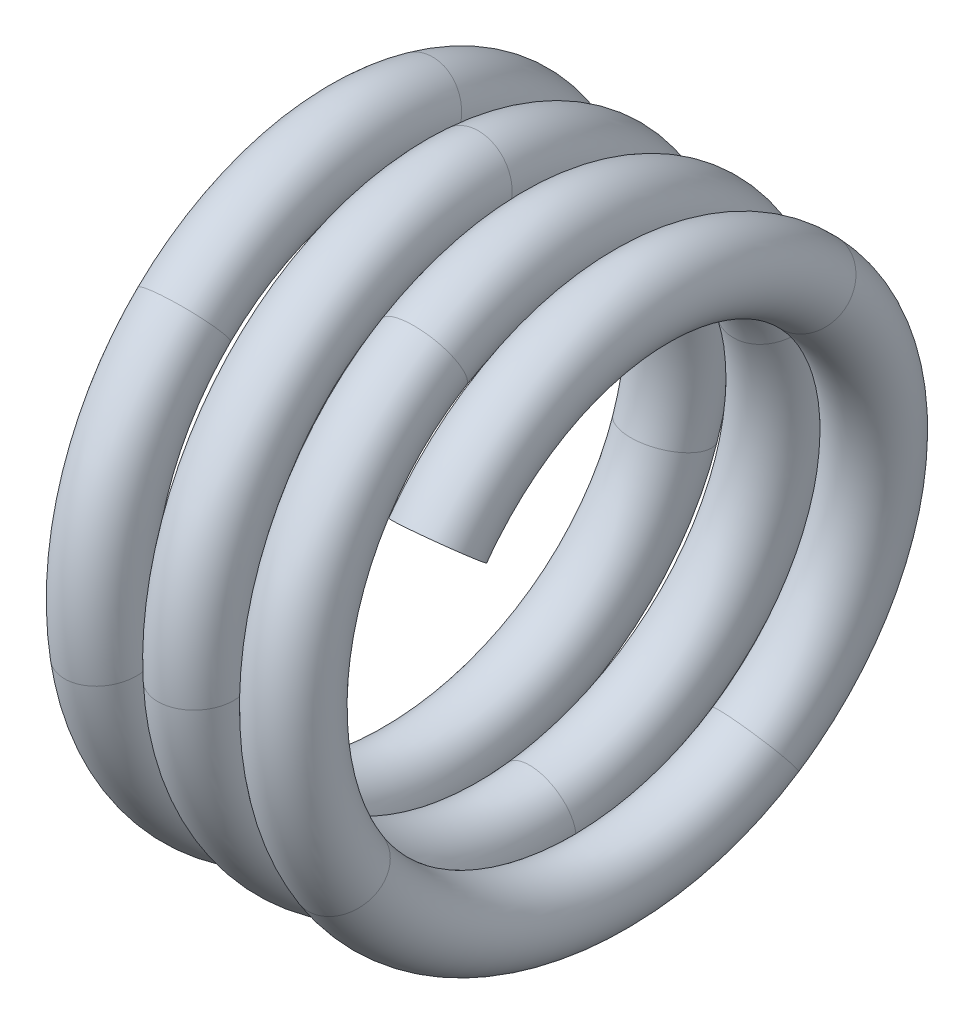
ISO-10303-21;
HEADER;
FILE_DESCRIPTION(('STEP AP214'),'2;1');
FILE_NAME('part.step','',(''),(''),'','','');
FILE_SCHEMA(('AUTOMOTIVE_DESIGN { 1 0 10303 214 1 1 1 1 }'));
ENDSEC;
DATA;
#1=APPLICATION_CONTEXT('core data for automotive mechanical design processes');
#2=APPLICATION_PROTOCOL_DEFINITION('international standard','automotive_design',2000,#1);
#3=PRODUCT_CONTEXT('',#1,'mechanical');
#4=PRODUCT('Part','Part','',(#3));
#5=PRODUCT_RELATED_PRODUCT_CATEGORY('part','',(#4));
#6=PRODUCT_DEFINITION_FORMATION('','',#4);
#7=PRODUCT_DEFINITION_CONTEXT('part definition',#1,'design');
#8=PRODUCT_DEFINITION('design','',#6,#7);
#9=PRODUCT_DEFINITION_SHAPE('','',#8);
#10=(LENGTH_UNIT() NAMED_UNIT(*) SI_UNIT(.MILLI.,.METRE.));
#11=(NAMED_UNIT(*) PLANE_ANGLE_UNIT() SI_UNIT($,.RADIAN.));
#12=(NAMED_UNIT(*) SI_UNIT($,.STERADIAN.) SOLID_ANGLE_UNIT());
#13=UNCERTAINTY_MEASURE_WITH_UNIT(LENGTH_MEASURE(1.E-05),#10,'distance_accuracy_value','');
#14=(GEOMETRIC_REPRESENTATION_CONTEXT(3) GLOBAL_UNCERTAINTY_ASSIGNED_CONTEXT((#13)) GLOBAL_UNIT_ASSIGNED_CONTEXT((#10,
#11,#12)) REPRESENTATION_CONTEXT('',''));
#15=CARTESIAN_POINT('',(0.,0.,0.));
#16=DIRECTION('',(0.,0.,1.));
#17=DIRECTION('',(1.,0.,0.));
#18=AXIS2_PLACEMENT_3D('',#15,#16,#17);
#19=CARTESIAN_POINT('',(-5.715,48.4899319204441,5.50100058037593));
#20=DIRECTION('',(-0.0566234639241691,-0.964376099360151,-0.258403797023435));
#21=DIRECTION('',(0.,0.258819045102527,-0.965925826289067));
#22=AXIS2_PLACEMENT_3D('',#19,#20,#21);
#23=PLANE('',#22);
#24=CARTESIAN_POINT('',(-5.70701517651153,48.3843308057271,5.8933596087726));
#25=CARTESIAN_POINT('',(-5.68424170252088,48.383199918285,5.89258983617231));
#26=CARTESIAN_POINT('',(-5.6614853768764,48.3825680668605,5.88996139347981));
#27=CARTESIAN_POINT('',(-5.61665573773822,48.3823248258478,5.88104575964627));
#28=CARTESIAN_POINT('',(-5.59458399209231,48.3827156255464,5.87475074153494));
#29=CARTESIAN_POINT('',(-5.55182699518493,48.3845083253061,5.85869104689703));
#30=CARTESIAN_POINT('',(-5.53113934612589,48.3859084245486,5.84893256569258));
#31=CARTESIAN_POINT('',(-5.49166932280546,48.3896810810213,5.82620383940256));
#32=CARTESIAN_POINT('',(-5.47288970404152,48.3920550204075,5.8132290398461));
#33=CARTESIAN_POINT('',(-5.4378272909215,48.3977038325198,5.78446423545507));
#34=CARTESIAN_POINT('',(-5.4215410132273,48.400977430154,5.76867822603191));
#35=CARTESIAN_POINT('',(-5.39187446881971,48.4083394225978,5.73470213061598));
#36=CARTESIAN_POINT('',(-5.37849830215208,48.4124289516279,5.71650871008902));
#37=CARTESIAN_POINT('',(-5.3550698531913,48.4213003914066,5.67826622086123));
#38=CARTESIAN_POINT('',(-5.34501515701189,48.4260817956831,5.65821851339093));
#39=CARTESIAN_POINT('',(-5.32850111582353,48.436203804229,5.61682397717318));
#40=CARTESIAN_POINT('',(-5.3220419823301,48.4415444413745,5.59547707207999));
#41=CARTESIAN_POINT('',(-5.31290350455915,48.4526328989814,5.55209189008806));
#42=CARTESIAN_POINT('',(-5.31022404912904,48.4583807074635,5.53005363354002));
#43=CARTESIAN_POINT('',(-5.30872062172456,48.4701204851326,5.48591074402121));
#44=CARTESIAN_POINT('',(-5.3098966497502,48.4761124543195,5.46380611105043));
#45=CARTESIAN_POINT('',(-5.31607090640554,48.4881706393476,5.4201573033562));
#46=CARTESIAN_POINT('',(-5.32106924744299,48.4942368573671,5.39861314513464));
#47=CARTESIAN_POINT('',(-5.33474593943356,48.5062707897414,5.35669884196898));
#48=CARTESIAN_POINT('',(-5.34342407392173,48.512238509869,5.33632862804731));
#49=CARTESIAN_POINT('',(-5.36422165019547,48.523910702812,5.29732473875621));
#50=CARTESIAN_POINT('',(-5.37634359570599,48.5296149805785,5.27869233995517));
#51=CARTESIAN_POINT('',(-5.40366239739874,48.5405857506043,5.24373517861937));
#52=CARTESIAN_POINT('',(-5.41885493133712,48.5458528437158,5.22740722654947));
#53=CARTESIAN_POINT('',(-5.4519180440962,48.5558159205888,5.1974695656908));
#54=CARTESIAN_POINT('',(-5.46979237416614,48.5605110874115,5.18386372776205));
#55=CARTESIAN_POINT('',(-5.50766884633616,48.5691819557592,5.15980339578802));
#56=CARTESIAN_POINT('',(-5.52766792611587,48.5731586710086,5.14934444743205));
#57=CARTESIAN_POINT('',(-5.56928152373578,48.5802944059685,5.13183221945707));
#58=CARTESIAN_POINT('',(-5.59089885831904,48.5834519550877,5.12478504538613));
#59=CARTESIAN_POINT('',(-5.63506901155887,48.5888449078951,5.11433718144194));
#60=CARTESIAN_POINT('',(-5.65761973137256,48.5910822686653,5.11092872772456));
#61=CARTESIAN_POINT('',(-5.69450248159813,48.5939239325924,5.10840553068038));
#62=CARTESIAN_POINT('',(-5.70874700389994,48.5948260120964,5.10816029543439));
#63=CARTESIAN_POINT('',(-5.74575829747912,48.5966639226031,5.10941132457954));
#64=CARTESIAN_POINT('',(-5.7685146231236,48.5972957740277,5.11203976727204));
#65=CARTESIAN_POINT('',(-5.81334426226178,48.5975390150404,5.12095540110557));
#66=CARTESIAN_POINT('',(-5.83541600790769,48.5971482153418,5.1272504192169));
#67=CARTESIAN_POINT('',(-5.87817300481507,48.595355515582,5.14331011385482));
#68=CARTESIAN_POINT('',(-5.8988606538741,48.5939554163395,5.15306859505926));
#69=CARTESIAN_POINT('',(-5.93833067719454,48.5901827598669,5.17579732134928));
#70=CARTESIAN_POINT('',(-5.95711029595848,48.5878088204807,5.18877212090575));
#71=CARTESIAN_POINT('',(-5.99217270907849,48.5821600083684,5.21753692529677));
#72=CARTESIAN_POINT('',(-6.00845898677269,48.5788864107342,5.23332293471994));
#73=CARTESIAN_POINT('',(-6.03812553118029,48.5715244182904,5.26729903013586));
#74=CARTESIAN_POINT('',(-6.05150169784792,48.5674348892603,5.28549245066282));
#75=CARTESIAN_POINT('',(-6.0749301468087,48.5585634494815,5.32373493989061));
#76=CARTESIAN_POINT('',(-6.08498484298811,48.5537820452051,5.34378264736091));
#77=CARTESIAN_POINT('',(-6.10149888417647,48.5436600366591,5.38517718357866));
#78=CARTESIAN_POINT('',(-6.1079580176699,48.5383193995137,5.40652408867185));
#79=CARTESIAN_POINT('',(-6.11709649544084,48.5272309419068,5.44990927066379));
#80=CARTESIAN_POINT('',(-6.11977595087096,48.5214831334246,5.47194752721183));
#81=CARTESIAN_POINT('',(-6.12127937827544,48.5097433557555,5.51609041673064));
#82=CARTESIAN_POINT('',(-6.1201033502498,48.5037513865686,5.53819504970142));
#83=CARTESIAN_POINT('',(-6.11392909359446,48.4916932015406,5.58184385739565));
#84=CARTESIAN_POINT('',(-6.10893075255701,48.4856269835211,5.60338801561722));
#85=CARTESIAN_POINT('',(-6.09525406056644,48.4735930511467,5.64530231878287));
#86=CARTESIAN_POINT('',(-6.08657592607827,48.4676253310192,5.66567253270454));
#87=CARTESIAN_POINT('',(-6.06577834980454,48.4559531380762,5.70467642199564));
#88=CARTESIAN_POINT('',(-6.05365640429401,48.4502488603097,5.72330882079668));
#89=CARTESIAN_POINT('',(-6.02633760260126,48.4392780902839,5.75826598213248));
#90=CARTESIAN_POINT('',(-6.01114506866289,48.4340109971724,5.77459393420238));
#91=CARTESIAN_POINT('',(-5.9780819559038,48.4240479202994,5.80453159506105));
#92=CARTESIAN_POINT('',(-5.96020762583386,48.4193527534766,5.8181374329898));
#93=CARTESIAN_POINT('',(-5.92233115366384,48.4106818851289,5.84219776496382));
#94=CARTESIAN_POINT('',(-5.90233207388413,48.4067051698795,5.8526567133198));
#95=CARTESIAN_POINT('',(-5.86071847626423,48.3995694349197,5.87016894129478));
#96=CARTESIAN_POINT('',(-5.83910114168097,48.3964118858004,5.87721611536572));
#97=CARTESIAN_POINT('',(-5.79493098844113,48.391018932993,5.8876639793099));
#98=CARTESIAN_POINT('',(-5.77238026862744,48.3887815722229,5.89107243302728));
#99=CARTESIAN_POINT('',(-5.73549751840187,48.3859399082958,5.89359563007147));
#100=CARTESIAN_POINT('',(-5.72125299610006,48.3850378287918,5.89384086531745));
#101=CARTESIAN_POINT('',(-5.70701517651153,48.3843308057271,5.8933596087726));
#102=B_SPLINE_CURVE_WITH_KNOTS('',3,(#24,#25,#26,#27,#28,#29,#30,#31,#32,#33,#34,#35,#36,#37,
#38,#39,#40,#41,#42,#43,#44,#45,#46,#47,#48,#49,#50,#51,#52,#53,#54,#55,#56,#57,#58,#59,#60,#61,
#62,#63,#64,#65,#66,#67,#68,#69,#70,#71,#72,#73,#74,#75,#76,#77,#78,#79,#80,#81,#82,#83,#84,#85,
#86,#87,#88,#89,#90,#91,#92,#93,#94,#95,#96,#97,#98,#99,#100,#101),.UNSPECIFIED.,.T.,.F.,(4,2,2,
2,2,2,2,2,2,2,2,2,2,2,2,2,2,2,2,2,2,2,2,2,2,2,2,2,2,2,2,2,2,2,2,2,2,2,4),(0.,0.0683988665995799,
0.136944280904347,0.205367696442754,0.273888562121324,0.342312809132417,0.410832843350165,
0.479302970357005,0.547777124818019,0.616249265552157,0.684721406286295,0.753195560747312,
0.821665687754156,0.890185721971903,0.958609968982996,1.02713083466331,1.09555425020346,
1.16409966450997,1.23249853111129,1.27526103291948,1.34365989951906,1.41220531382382,
1.48062872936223,1.5491495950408,1.61757384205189,1.68609387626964,1.75456400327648,
1.8230381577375,1.89151029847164,1.95998243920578,2.0284565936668,2.09692672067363,
2.16544675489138,2.23387100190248,2.30239186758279,2.37081528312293,2.43936069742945,
2.50775956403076,2.55052206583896),.UNSPECIFIED.);
#103=CARTESIAN_POINT('',(-5.70701517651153,48.3843308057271,5.8933596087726));
#104=VERTEX_POINT('',#103);
#105=EDGE_CURVE('E20',#104,#104,#102,.T.);
#106=ORIENTED_EDGE('',*,*,#105,.F.);
#107=EDGE_LOOP('',(#106));
#108=FACE_BOUND('',#107,.T.);
#109=ADVANCED_FACE('F15',(#108),#23,.T.);
#110=CARTESIAN_POINT('',(-5.65891132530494,47.7481463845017,8.25709129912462));
#111=DIRECTION('',(-0.998202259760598,0.049590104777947,0.0336611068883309));
#112=DIRECTION('',(0.0566234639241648,0.964376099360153,0.258403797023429));
#113=AXIS2_PLACEMENT_3D('',#110,#111,#112);
#114=TOROIDAL_SURFACE('',#113,2.85472026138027,0.4064);
#115=CARTESIAN_POINT('',(-5.55337484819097,50.4643835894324,7.38511350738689));
#116=DIRECTION('',(-0.0471755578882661,-0.303657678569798,-0.951612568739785));
#117=DIRECTION('',(-0.0368704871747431,0.952553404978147,-0.302130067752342));
#118=AXIS2_PLACEMENT_3D('',#115,#116,#117);
#119=CIRCLE('',#118,0.4064);
#120=CARTESIAN_POINT('',(-5.56835901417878,50.8515012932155,7.26232784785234));
#121=VERTEX_POINT('',#120);
#122=EDGE_CURVE('E207',#121,#121,#119,.F.);
#123=ORIENTED_EDGE('',*,*,#122,.F.);
#124=EDGE_LOOP('',(#123));
#125=FACE_BOUND('',#124,.T.);
#126=ORIENTED_EDGE('',*,*,#105,.T.);
#127=EDGE_LOOP('',(#126));
#128=FACE_BOUND('',#127,.T.);
#129=ADVANCED_FACE('F182',(#125,#128),#114,.T.);
#130=CARTESIAN_POINT('',(-5.44784807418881,47.73808687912,8.24983794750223));
#131=DIRECTION('',(-0.998205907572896,-0.0208332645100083,0.0561332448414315));
#132=DIRECTION('',(0.0596135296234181,-0.258358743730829,0.964207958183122));
#133=AXIS2_PLACEMENT_3D('',#130,#131,#132);
#134=TOROIDAL_SURFACE('',#133,2.86209329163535,0.4064);
#135=CARTESIAN_POINT('',(-5.39181253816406,49.9487780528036,10.0667811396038));
#136=DIRECTION('',(-0.0565831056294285,0.634790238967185,-0.770609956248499));
#137=DIRECTION('',(-0.0194448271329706,0.770999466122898,0.636538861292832));
#138=AXIS2_PLACEMENT_3D('',#135,#136,#137);
#139=CIRCLE('',#138,0.4064);
#140=CARTESIAN_POINT('',(-5.3997149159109,50.262112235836,10.3254705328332));
#141=VERTEX_POINT('',#140);
#142=EDGE_CURVE('E46',#141,#141,#139,.F.);
#143=ORIENTED_EDGE('',*,*,#142,.F.);
#144=EDGE_LOOP('',(#143));
#145=FACE_BOUND('',#144,.T.);
#146=ORIENTED_EDGE('',*,*,#122,.T.);
#147=EDGE_LOOP('',(#146));
#148=FACE_BOUND('',#147,.T.);
#149=ADVANCED_FACE('F174',(#145,#148),#134,.T.);
#150=CARTESIAN_POINT('',(-5.12427549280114,47.7505319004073,8.26145350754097));
#151=DIRECTION('',(-0.998198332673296,-0.0423209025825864,-0.0425326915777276));
#152=DIRECTION('',(-0.0519106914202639,0.964623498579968,0.258470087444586));
#153=AXIS2_PLACEMENT_3D('',#150,#151,#152);
#154=TOROIDAL_SURFACE('',#153,2.84652874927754,0.4064);
#155=CARTESIAN_POINT('',(-5.06862507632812,45.1898121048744,9.50336456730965));
#156=DIRECTION('',(-0.0567263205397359,0.434672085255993,0.898800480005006));
#157=DIRECTION('',(-0.0363871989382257,-0.900552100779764,0.433222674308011));
#158=AXIS2_PLACEMENT_3D('',#155,#156,#157);
#159=CIRCLE('',#158,0.4064);
#160=CARTESIAN_POINT('',(-5.08341283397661,44.8238277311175,9.67942626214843));
#161=VERTEX_POINT('',#160);
#162=EDGE_CURVE('E10',#161,#161,#159,.F.);
#163=ORIENTED_EDGE('',*,*,#162,.F.);
#164=EDGE_LOOP('',(#163));
#165=FACE_BOUND('',#164,.T.);
#166=CARTESIAN_POINT('',(-5.2303304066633,47.4133541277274,11.0859515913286));
#167=DIRECTION('',(-0.0470314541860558,0.992057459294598,0.116662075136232));
#168=DIRECTION('',(0.0369836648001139,-0.114981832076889,0.99267889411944));
#169=AXIS2_PLACEMENT_3D('',#166,#167,#168);
#170=CIRCLE('',#169,0.4064);
#171=CARTESIAN_POINT('',(-5.21530024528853,47.3666255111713,11.4893762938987));
#172=VERTEX_POINT('',#171);
#173=EDGE_CURVE('E210',#172,#172,#170,.T.);
#174=ORIENTED_EDGE('',*,*,#173,.F.);
#175=EDGE_LOOP('',(#174));
#176=FACE_BOUND('',#175,.T.);
#177=ADVANCED_FACE('F167',(#165,#176),#154,.T.);
#178=CARTESIAN_POINT('',(-5.33616702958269,47.74239909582,8.24518980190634));
#179=DIRECTION('',(-0.998208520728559,-0.051001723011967,0.0312821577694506));
#180=DIRECTION('',(0.0434532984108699,-0.25857457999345,0.965013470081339));
#181=AXIS2_PLACEMENT_3D('',#178,#179,#180);
#182=TOROIDAL_SURFACE('',#181,2.86171269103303,0.4064);
#183=ORIENTED_EDGE('',*,*,#173,.T.);
#184=EDGE_LOOP('',(#183));
#185=FACE_BOUND('',#184,.T.);
#186=ORIENTED_EDGE('',*,*,#142,.T.);
#187=EDGE_LOOP('',(#186));
#188=FACE_BOUND('',#187,.T.);
#189=ADVANCED_FACE('F160',(#185,#188),#182,.T.);
#190=CARTESIAN_POINT('',(-2.3142448,49.5831595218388,10.4375637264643));
#191=DIRECTION('',(-0.0566634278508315,0.762154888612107,-0.644910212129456));
#192=DIRECTION('',(0.,0.64594803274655,0.763381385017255));
#193=AXIS2_PLACEMENT_3D('',#190,#191,#192);
#194=PLANE('',#193);
#195=CARTESIAN_POINT('',(-2.32846079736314,49.3201915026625,10.1280371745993));
#196=CARTESIAN_POINT('',(-2.35122461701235,49.3197227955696,10.129483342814));
#197=CARTESIAN_POINT('',(-2.37394177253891,49.3204989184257,10.1323965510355));
#198=CARTESIAN_POINT('',(-2.41863489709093,49.3245296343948,10.1410869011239));
#199=CARTESIAN_POINT('',(-2.44060917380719,49.327789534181,10.1468701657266));
#200=CARTESIAN_POINT('',(-2.48311598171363,49.3366916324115,10.1611254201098));
#201=CARTESIAN_POINT('',(-2.50365100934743,49.342329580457,10.1695926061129));
#202=CARTESIAN_POINT('',(-2.54276457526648,49.3558375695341,10.1889929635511));
#203=CARTESIAN_POINT('',(-2.56134028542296,49.3637107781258,10.1999296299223));
#204=CARTESIAN_POINT('',(-2.59594989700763,49.38144941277,10.2239340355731));
#205=CARTESIAN_POINT('',(-2.61198734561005,49.3913120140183,10.2369987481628));
#206=CARTESIAN_POINT('',(-2.64111772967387,49.4127719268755,10.2649195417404));
#207=CARTESIAN_POINT('',(-2.6542065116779,49.42437164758,10.2797781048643));
#208=CARTESIAN_POINT('',(-2.67703035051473,49.4489567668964,10.3108381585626));
#209=CARTESIAN_POINT('',(-2.68676784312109,49.461941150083,10.3270386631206));
#210=CARTESIAN_POINT('',(-2.70262644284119,49.4889348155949,10.3603331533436));
#211=CARTESIAN_POINT('',(-2.70874733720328,49.5029441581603,10.3774271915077));
#212=CARTESIAN_POINT('',(-2.71719793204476,49.5315889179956,10.4120220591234));
#213=CARTESIAN_POINT('',(-2.71952774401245,49.5462243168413,10.4295228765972));
#214=CARTESIAN_POINT('',(-2.72033039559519,49.5757061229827,10.4644349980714));
#215=CARTESIAN_POINT('',(-2.71880323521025,49.5905525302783,10.4818463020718));
#216=CARTESIAN_POINT('',(-2.71193518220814,49.6200353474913,10.5160856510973));
#217=CARTESIAN_POINT('',(-2.70659417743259,49.63467175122,10.5329136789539));
#218=CARTESIAN_POINT('',(-2.69225038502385,49.6633177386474,10.5655072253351));
#219=CARTESIAN_POINT('',(-2.68324781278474,49.6773273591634,10.5812728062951));
#220=CARTESIAN_POINT('',(-2.66182854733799,49.7043329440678,10.6113060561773));
#221=CARTESIAN_POINT('',(-2.64940937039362,49.7173281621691,10.6255726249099));
#222=CARTESIAN_POINT('',(-2.62153240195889,49.7419068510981,10.6521703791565));
#223=CARTESIAN_POINT('',(-2.60607888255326,49.7534922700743,10.6645042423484));
#224=CARTESIAN_POINT('',(-2.57253665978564,49.7749593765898,10.6869269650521));
#225=CARTESIAN_POINT('',(-2.55444426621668,49.7848386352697,10.6970126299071));
#226=CARTESIAN_POINT('',(-2.51618146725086,49.8025797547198,10.7146172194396));
#227=CARTESIAN_POINT('',(-2.49601405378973,49.8104444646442,10.7221397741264));
#228=CARTESIAN_POINT('',(-2.45411768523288,49.8239641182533,10.7344361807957));
#229=CARTESIAN_POINT('',(-2.43238601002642,49.8296150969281,10.7392051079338));
#230=CARTESIAN_POINT('',(-2.38804497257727,49.8385167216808,10.7458291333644));
#231=CARTESIAN_POINT('',(-2.36543758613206,49.8417724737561,10.7476904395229));
#232=CARTESIAN_POINT('',(-2.32851060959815,49.8450549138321,10.7483251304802));
#233=CARTESIAN_POINT('',(-2.3142605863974,49.8458345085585,10.7479944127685));
#234=CARTESIAN_POINT('',(-2.27726498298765,49.8465962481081,10.7456441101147));
#235=CARTESIAN_POINT('',(-2.25454782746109,49.8458201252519,10.7427309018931));
#236=CARTESIAN_POINT('',(-2.20985470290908,49.8417894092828,10.7340405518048));
#237=CARTESIAN_POINT('',(-2.18788042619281,49.8385295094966,10.7282572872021));
#238=CARTESIAN_POINT('',(-2.14537361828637,49.8296274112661,10.7140020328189));
#239=CARTESIAN_POINT('',(-2.12483859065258,49.8239894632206,10.7055348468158));
#240=CARTESIAN_POINT('',(-2.08572502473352,49.8104814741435,10.6861344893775));
#241=CARTESIAN_POINT('',(-2.06714931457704,49.8026082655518,10.6751978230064));
#242=CARTESIAN_POINT('',(-2.03253970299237,49.7848696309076,10.6511934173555));
#243=CARTESIAN_POINT('',(-2.01650225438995,49.7750070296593,10.6381287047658));
#244=CARTESIAN_POINT('',(-1.98737187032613,49.7535471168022,10.6102079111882));
#245=CARTESIAN_POINT('',(-1.97428308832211,49.7419473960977,10.5953493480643));
#246=CARTESIAN_POINT('',(-1.95145924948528,49.7173622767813,10.564289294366));
#247=CARTESIAN_POINT('',(-1.94172175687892,49.7043778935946,10.548088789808));
#248=CARTESIAN_POINT('',(-1.92586315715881,49.6773842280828,10.514794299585));
#249=CARTESIAN_POINT('',(-1.91974226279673,49.6633748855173,10.4977002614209));
#250=CARTESIAN_POINT('',(-1.91129166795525,49.6347301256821,10.4631053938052));
#251=CARTESIAN_POINT('',(-1.90896185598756,49.6200947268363,10.4456045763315));
#252=CARTESIAN_POINT('',(-1.90815920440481,49.590612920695,10.4106924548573));
#253=CARTESIAN_POINT('',(-1.90968636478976,49.5757665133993,10.3932811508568));
#254=CARTESIAN_POINT('',(-1.91655441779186,49.5462836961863,10.3590418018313));
#255=CARTESIAN_POINT('',(-1.9218954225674,49.5316472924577,10.3422137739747));
#256=CARTESIAN_POINT('',(-1.93623921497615,49.5030013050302,10.3096202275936));
#257=CARTESIAN_POINT('',(-1.94524178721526,49.4889916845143,10.2938546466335));
#258=CARTESIAN_POINT('',(-1.96666105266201,49.4619860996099,10.2638213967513));
#259=CARTESIAN_POINT('',(-1.97908022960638,49.4489908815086,10.2495548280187));
#260=CARTESIAN_POINT('',(-2.00695719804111,49.4244121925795,10.2229570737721));
#261=CARTESIAN_POINT('',(-2.02241071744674,49.4128267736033,10.2106232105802));
#262=CARTESIAN_POINT('',(-2.05595294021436,49.3913596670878,10.1882004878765));
#263=CARTESIAN_POINT('',(-2.07404533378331,49.3814804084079,10.1781148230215));
#264=CARTESIAN_POINT('',(-2.11230813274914,49.3637392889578,10.160510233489));
#265=CARTESIAN_POINT('',(-2.13247554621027,49.3558745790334,10.1529876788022));
#266=CARTESIAN_POINT('',(-2.17437191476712,49.3423549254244,10.1406912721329));
#267=CARTESIAN_POINT('',(-2.19610358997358,49.3367039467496,10.1359223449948));
#268=CARTESIAN_POINT('',(-2.24044462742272,49.3278023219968,10.1292983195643));
#269=CARTESIAN_POINT('',(-2.26305201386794,49.3245465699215,10.1274370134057));
#270=CARTESIAN_POINT('',(-2.29997899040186,49.3212641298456,10.1268023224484));
#271=CARTESIAN_POINT('',(-2.31422901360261,49.3204845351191,10.1271330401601));
#272=CARTESIAN_POINT('',(-2.32846079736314,49.3201915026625,10.1280371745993));
#273=B_SPLINE_CURVE_WITH_KNOTS('',3,(#195,#196,#197,#198,#199,#200,#201,#202,#203,#204,#205,
#206,#207,#208,#209,#210,#211,#212,#213,#214,#215,#216,#217,#218,#219,#220,#221,#222,#223,#224,
#225,#226,#227,#228,#229,#230,#231,#232,#233,#234,#235,#236,#237,#238,#239,#240,#241,#242,#243,
#244,#245,#246,#247,#248,#249,#250,#251,#252,#253,#254,#255,#256,#257,#258,#259,#260,#261,#262,
#263,#264,#265,#266,#267,#268,#269,#270,#271,#272),.UNSPECIFIED.,.T.,.F.,(4,2,2,2,2,2,2,2,2,2,2,
2,2,2,2,2,2,2,2,2,2,2,2,2,2,2,2,2,2,2,2,2,2,2,2,2,2,2,4),(0.,0.0683988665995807,
0.136944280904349,0.205367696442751,0.273888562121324,0.342312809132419,0.410832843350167,
0.479302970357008,0.547777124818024,0.616249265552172,0.684721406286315,0.753195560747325,
0.821665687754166,0.890185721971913,0.958609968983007,1.02713083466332,1.09555425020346,
1.16409966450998,1.23249853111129,1.27526103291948,1.34365989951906,1.41220531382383,
1.48062872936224,1.54914959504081,1.6175738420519,1.68609387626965,1.75456400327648,
1.8230381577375,1.89151029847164,1.95998243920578,2.02845659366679,2.09692672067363,
2.16544675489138,2.23387100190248,2.30239186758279,2.37081528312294,2.43936069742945,
2.50775956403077,2.55052206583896),.UNSPECIFIED.);
#274=CARTESIAN_POINT('',(-2.32846079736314,49.3201915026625,10.1280371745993));
#275=VERTEX_POINT('',#274);
#276=EDGE_CURVE('E40',#275,#275,#273,.T.);
#277=ORIENTED_EDGE('',*,*,#276,.F.);
#278=EDGE_LOOP('',(#277));
#279=FACE_BOUND('',#278,.T.);
#280=ADVANCED_FACE('F47',(#279),#194,.F.);
#281=CARTESIAN_POINT('',(-2.41425148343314,47.7332323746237,8.26010666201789));
#282=DIRECTION('',(0.997780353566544,0.0205974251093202,-0.0633254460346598));
#283=DIRECTION('',(-0.0664990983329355,0.258246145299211,-0.963787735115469));
#284=AXIS2_PLACEMENT_3D('',#281,#282,#283);
#285=TOROIDAL_SURFACE('',#284,2.85894229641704,0.4064);
#286=CARTESIAN_POINT('',(-2.5853711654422,49.7179140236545,6.2094219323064));
#287=DIRECTION('',(-0.0291863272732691,-0.719486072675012,-0.693893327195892));
#288=DIRECTION('',(0.0598991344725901,0.691682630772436,-0.719713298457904));
#289=AXIS2_PLACEMENT_3D('',#286,#287,#288);
#290=CIRCLE('',#289,0.4064);
#291=CARTESIAN_POINT('',(-2.56102815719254,49.9990138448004,5.91693044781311));
#292=VERTEX_POINT('',#291);
#293=EDGE_CURVE('E37',#292,#292,#290,.T.);
#294=ORIENTED_EDGE('',*,*,#293,.F.);
#295=EDGE_LOOP('',(#294));
#296=FACE_BOUND('',#295,.T.);
#297=ORIENTED_EDGE('',*,*,#276,.T.);
#298=EDGE_LOOP('',(#297));
#299=FACE_BOUND('',#298,.T.);
#300=ADVANCED_FACE('F50',(#296,#299),#285,.T.);
#301=CARTESIAN_POINT('',(-2.75600126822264,47.7475703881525,8.25961439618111));
#302=DIRECTION('',(-0.99777765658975,0.0625693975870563,-0.0229089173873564));
#303=DIRECTION('',(0.0545482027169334,0.964487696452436,0.258433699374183));
#304=AXIS2_PLACEMENT_3D('',#301,#302,#303);
#305=TOROIDAL_SURFACE('',#304,2.84862384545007,0.4064);
#306=CARTESIAN_POINT('',(-2.85624016,45.5063569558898,6.50417361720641));
#307=DIRECTION('',(-0.0565819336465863,-0.614066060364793,0.787223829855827));
#308=DIRECTION('',(0.0352111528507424,-0.7892238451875,-0.61309534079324));
#309=AXIS2_PLACEMENT_3D('',#306,#307,#308);
#310=CIRCLE('',#309,0.4064);
#311=CARTESIAN_POINT('',(-2.84193034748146,45.1856163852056,6.25501167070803));
#312=VERTEX_POINT('',#311);
#313=EDGE_CURVE('E39',#312,#312,#310,.T.);
#314=ORIENTED_EDGE('',*,*,#313,.F.);
#315=EDGE_LOOP('',(#314));
#316=FACE_BOUND('',#315,.T.);
#317=ORIENTED_EDGE('',*,*,#293,.T.);
#318=EDGE_LOOP('',(#317));
#319=FACE_BOUND('',#318,.T.);
#320=ADVANCED_FACE('F55',(#316,#319),#305,.T.);
#321=CARTESIAN_POINT('',(-2.95649842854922,47.7535488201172,8.24986702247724));
#322=DIRECTION('',(-0.997776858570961,0.00697106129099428,-0.0662777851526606));
#323=DIRECTION('',(-0.0658272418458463,-0.25825767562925,0.963830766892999));
#324=AXIS2_PLACEMENT_3D('',#321,#322,#323);
#325=TOROIDAL_SURFACE('',#324,2.84734410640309,0.4064);
#326=CARTESIAN_POINT('',(-3.12709287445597,46.246330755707,10.6595474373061));
#327=DIRECTION('',(-0.0291840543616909,0.848380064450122,0.528582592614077));
#328=DIRECTION('',(0.0598440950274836,-0.526376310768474,0.84814306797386));
#329=AXIS2_PLACEMENT_3D('',#326,#327,#328);
#330=CIRCLE('',#329,0.4064);
#331=CARTESIAN_POINT('',(-3.1027722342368,46.0324114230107,11.0042327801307));
#332=VERTEX_POINT('',#331);
#333=EDGE_CURVE('E66',#332,#332,#330,.T.);
#334=ORIENTED_EDGE('',*,*,#333,.F.);
#335=EDGE_LOOP('',(#334));
#336=FACE_BOUND('',#335,.T.);
#337=ORIENTED_EDGE('',*,*,#313,.T.);
#338=EDGE_LOOP('',(#337));
#339=FACE_BOUND('',#338,.T.);
#340=ADVANCED_FACE('F70',(#336,#339),#325,.T.);
#341=CARTESIAN_POINT('',(-3.29827698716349,47.7520308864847,8.23343307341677));
#342=DIRECTION('',(-0.997781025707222,-0.0563848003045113,0.035408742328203));
#343=DIRECTION('',(0.0488458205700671,-0.258510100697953,0.964772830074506));
#344=AXIS2_PLACEMENT_3D('',#341,#342,#343);
#345=TOROIDAL_SURFACE('',#344,2.86050131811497,0.4064);
#346=ORIENTED_EDGE('',*,*,#333,.T.);
#347=EDGE_LOOP('',(#346));
#348=FACE_BOUND('',#347,.T.);
#349=CARTESIAN_POINT('',(-3.39823552,50.3155028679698,9.49877392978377));
#350=DIRECTION('',(-0.0566737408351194,0.440130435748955,-0.896143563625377));
#351=DIRECTION('',(0.0354436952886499,0.897907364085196,0.438755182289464));
#352=AXIS2_PLACEMENT_3D('',#349,#350,#351);
#353=CIRCLE('',#352,0.4064);
#354=CARTESIAN_POINT('',(-3.38383120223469,50.680412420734,9.6770840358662));
#355=VERTEX_POINT('',#354);
#356=EDGE_CURVE('E83',#355,#355,#353,.T.);
#357=ORIENTED_EDGE('',*,*,#356,.F.);
#358=EDGE_LOOP('',(#357));
#359=FACE_BOUND('',#358,.T.);
#360=ADVANCED_FACE('F73',(#348,#359),#345,.T.);
#361=CARTESIAN_POINT('',(-3.49944322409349,47.7515731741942,8.24593039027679));
#362=DIRECTION('',(-0.99776341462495,0.00689674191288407,0.0664876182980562));
#363=DIRECTION('',(0.0624548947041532,-0.258313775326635,0.964040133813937));
#364=AXIS2_PLACEMENT_3D('',#361,#362,#363);
#365=TOROIDAL_SURFACE('',#364,2.85545012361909,0.4064);
#366=ORIENTED_EDGE('',*,*,#356,.T.);
#367=EDGE_LOOP('',(#366));
#368=FACE_BOUND('',#367,.T.);
#369=CARTESIAN_POINT('',(-3.67333801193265,48.6547034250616,5.5426524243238));
#370=DIRECTION('',(-0.0275581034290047,-0.948639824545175,-0.315155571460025));
#371=DIRECTION('',(0.0609298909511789,0.313095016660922,-0.947765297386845));
#372=AXIS2_PLACEMENT_3D('',#369,#370,#371);
#373=CIRCLE('',#372,0.4064);
#374=CARTESIAN_POINT('',(-3.64857610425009,48.7819452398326,5.15748060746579));
#375=VERTEX_POINT('',#374);
#376=EDGE_CURVE('E85',#375,#375,#373,.T.);
#377=ORIENTED_EDGE('',*,*,#376,.F.);
#378=EDGE_LOOP('',(#377));
#379=FACE_BOUND('',#378,.T.);
#380=ADVANCED_FACE('F77',(#368,#379),#365,.T.);
#381=CARTESIAN_POINT('',(-3.84756315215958,47.7594281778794,8.25272689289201));
#382=DIRECTION('',(-0.997761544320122,0.0453210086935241,-0.0491722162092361));
#383=DIRECTION('',(-0.0592552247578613,-0.258364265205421,0.964228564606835));
#384=AXIS2_PLACEMENT_3D('',#381,#382,#383);
#385=TOROIDAL_SURFACE('',#384,2.85943627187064,0.4064);
#386=CARTESIAN_POINT('',(-3.9486995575,44.9523226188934,7.71765157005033));
#387=DIRECTION('',(-0.0567530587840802,-0.184968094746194,0.981104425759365));
#388=DIRECTION('',(0.0363261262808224,-0.982420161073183,-0.183114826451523));
#389=AXIS2_PLACEMENT_3D('',#386,#387,#388);
#390=CIRCLE('',#389,0.4064);
#391=CARTESIAN_POINT('',(-3.93393661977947,44.5530670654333,7.64323370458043));
#392=VERTEX_POINT('',#391);
#393=EDGE_CURVE('E90',#392,#392,#390,.T.);
#394=ORIENTED_EDGE('',*,*,#393,.F.);
#395=EDGE_LOOP('',(#394));
#396=FACE_BOUND('',#395,.T.);
#397=ORIENTED_EDGE('',*,*,#376,.T.);
#398=EDGE_LOOP('',(#397));
#399=FACE_BOUND('',#398,.T.);
#400=ADVANCED_FACE('F94',(#396,#399),#385,.T.);
#401=CARTESIAN_POINT('',(-4.05255787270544,47.7611137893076,8.24118653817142));
#402=DIRECTION('',(-0.997727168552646,-0.0252473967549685,-0.0624745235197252));
#403=DIRECTION('',(-0.0538555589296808,-0.258443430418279,0.964524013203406));
#404=AXIS2_PLACEMENT_3D('',#401,#402,#403);
#405=TOROIDAL_SURFACE('',#404,2.85905285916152,0.4064);
#406=CARTESIAN_POINT('',(-4.22896658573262,47.6744648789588,11.0934760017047));
#407=DIRECTION('',(-0.0270810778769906,0.999221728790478,0.0286801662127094));
#408=DIRECTION('',(0.0616505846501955,-0.0269665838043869,0.997733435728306));
#409=AXIS2_PLACEMENT_3D('',#406,#407,#408);
#410=CIRCLE('',#409,0.4064);
#411=CARTESIAN_POINT('',(-4.20391178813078,47.6635056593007,11.4989548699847));
#412=VERTEX_POINT('',#411);
#413=EDGE_CURVE('E107',#412,#412,#410,.T.);
#414=ORIENTED_EDGE('',*,*,#413,.F.);
#415=EDGE_LOOP('',(#414));
#416=FACE_BOUND('',#415,.T.);
#417=ORIENTED_EDGE('',*,*,#393,.T.);
#418=EDGE_LOOP('',(#417));
#419=FACE_BOUND('',#418,.T.);
#420=ADVANCED_FACE('F97',(#416,#419),#405,.T.);
#421=CARTESIAN_POINT('',(-4.40464025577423,47.7513063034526,8.25042925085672));
#422=DIRECTION('',(-0.9977303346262,-0.028787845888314,0.0608723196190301));
#423=DIRECTION('',(0.0662538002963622,-0.258250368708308,0.963803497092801));
#424=AXIS2_PLACEMENT_3D('',#421,#422,#423);
#425=TOROIDAL_SURFACE('',#424,2.84950533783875,0.4064);
#426=ORIENTED_EDGE('',*,*,#413,.T.);
#427=EDGE_LOOP('',(#426));
#428=FACE_BOUND('',#427,.T.);
#429=CARTESIAN_POINT('',(-4.50866231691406,50.5748142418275,7.88074965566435));
#430=DIRECTION('',(-0.0565821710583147,-0.131662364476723,-0.989678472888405));
#431=DIRECTION('',(0.0365028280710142,0.990330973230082,-0.133836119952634));
#432=AXIS2_PLACEMENT_3D('',#429,#430,#431);
#433=CIRCLE('',#432,0.4064);
#434=CARTESIAN_POINT('',(-4.493827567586,50.9772847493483,7.8263586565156));
#435=VERTEX_POINT('',#434);
#436=EDGE_CURVE('E33',#435,#435,#433,.T.);
#437=ORIENTED_EDGE('',*,*,#436,.F.);
#438=EDGE_LOOP('',(#437));
#439=FACE_BOUND('',#438,.T.);
#440=ADVANCED_FACE('F101',(#428,#439),#425,.T.);
#441=CARTESIAN_POINT('',(-4.6127185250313,47.7517429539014,8.26226746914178));
#442=DIRECTION('',(-0.99773042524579,0.0436988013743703,0.0512290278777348));
#443=DIRECTION('',(0.0555093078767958,0.964436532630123,0.258419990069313));
#444=AXIS2_PLACEMENT_3D('',#441,#442,#443);
#445=TOROIDAL_SURFACE('',#444,2.85063414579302,0.4064);
#446=ORIENTED_EDGE('',*,*,#436,.T.);
#447=EDGE_LOOP('',(#446));
#448=FACE_BOUND('',#447,.T.);
#449=CARTESIAN_POINT('',(-4.78840282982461,46.9359957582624,5.53650031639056));
#450=DIRECTION('',(-0.0271247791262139,-0.957183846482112,0.28820709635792));
#451=DIRECTION('',(0.0616940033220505,-0.289366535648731,-0.955228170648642));
#452=AXIS2_PLACEMENT_3D('',#449,#450,#451);
#453=CIRCLE('',#452,0.4064);
#454=CARTESIAN_POINT('',(-4.76333038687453,46.8183971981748,5.14829558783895));
#455=VERTEX_POINT('',#454);
#456=EDGE_CURVE('E28',#455,#455,#453,.T.);
#457=ORIENTED_EDGE('',*,*,#456,.F.);
#458=EDGE_LOOP('',(#457));
#459=FACE_BOUND('',#458,.T.);
#460=ADVANCED_FACE('F113',(#448,#459),#445,.T.);
#461=CARTESIAN_POINT('',(-4.96466527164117,47.7627284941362,8.26562860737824));
#462=DIRECTION('',(-0.997726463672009,0.008129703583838,-0.0669015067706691));
#463=DIRECTION('',(-0.0667290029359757,-0.258242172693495,0.963772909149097));
#464=AXIS2_PLACEMENT_3D('',#461,#462,#463);
#465=TOROIDAL_SURFACE('',#464,2.85704334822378,0.4064);
#466=ORIENTED_EDGE('',*,*,#456,.T.);
#467=EDGE_LOOP('',(#466));
#468=FACE_BOUND('',#467,.T.);
#469=ORIENTED_EDGE('',*,*,#162,.T.);
#470=EDGE_LOOP('',(#469));
#471=FACE_BOUND('',#470,.T.);
#472=ADVANCED_FACE('F17',(#468,#471),#465,.T.);
#473=CLOSED_SHELL('',(#109,#129,#149,#177,#189,#280,#300,#320,#340,#360,#380,#400,#420,#440,
#460,#472));
#474=MANIFOLD_SOLID_BREP('B1',#473);
#475=ADVANCED_BREP_SHAPE_REPRESENTATION('',(#18,#474),#14);
#476=SHAPE_DEFINITION_REPRESENTATION(#9,#475);
ENDSEC;
END-ISO-10303-21;
